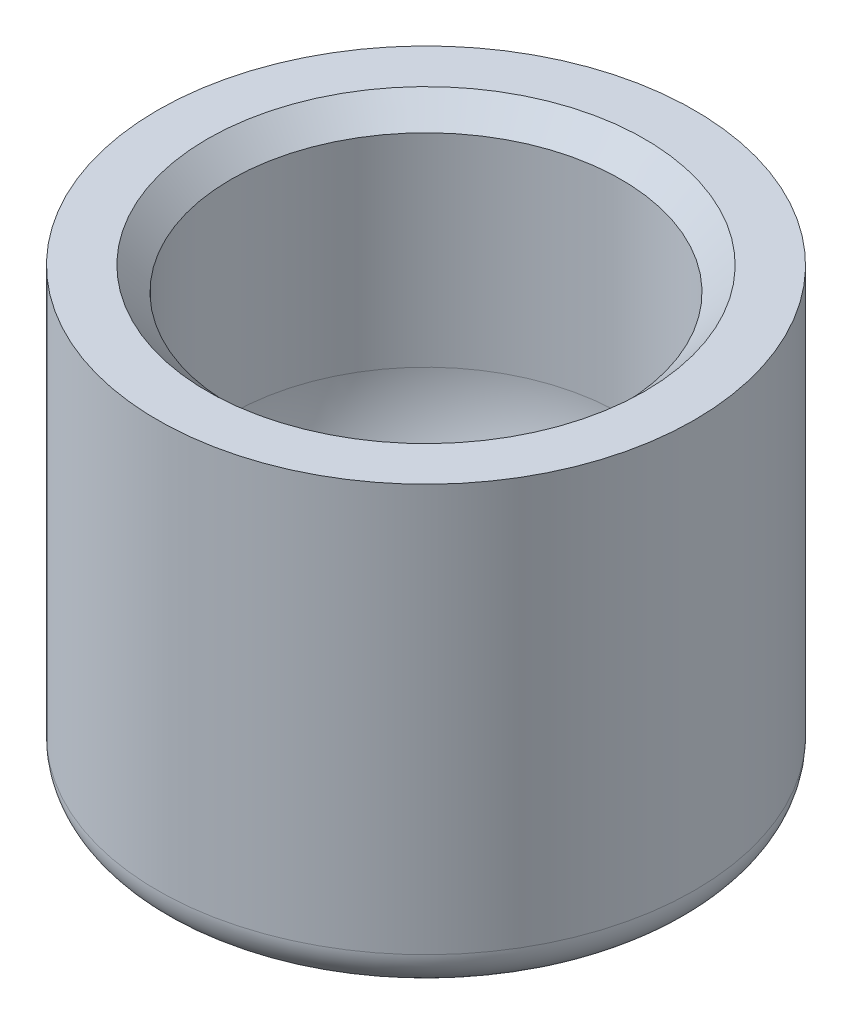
from build123d import *

# Parameters (mm, degrees)
CHAMFER1_SIZE = 0.762


with BuildPart() as part:
    # Sketch1 → Revolve1 (revolve)
    with BuildSketch(Plane.XY, mode=Mode.PRIVATE) as revolve1_sk:
        with BuildLine():
            Line((6.35, 0), (8.73125, 0))
            Line((8.73125, 0), (8.73125, -13.25435082))
            ThreePointArc((8.73125, -13.25435082), (8.567676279, -13.87782567), (8.11909112, -14.340695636))
            Line((8.11909112, -14.340695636), (0.635, -18.872721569))
            ThreePointArc((0.635, -18.872721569), (0.329640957, -19.004848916), (0, -19.05))
            Line((0, -19.05), (0, -13.716))
            ThreePointArc((0, -13.716), (4.490128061, -11.856128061), (6.35, -7.366))
            Line((6.35, -7.366), (6.35, 0))
        make_face()
    revolve(revolve1_sk.sketch.rotate(Axis((0, -13.716, 0), (0, -1, 0)), 180), axis=Axis((0, -13.716, 0), (0, -1, 0)))

    # Chamfer1
    chamfer1_edges = [part.edges().sort_by_distance(p)[0] for p in [
        (6.35, 0, 0),
    ]]
    chamfer(chamfer1_edges, length=CHAMFER1_SIZE)


solid = part.part
